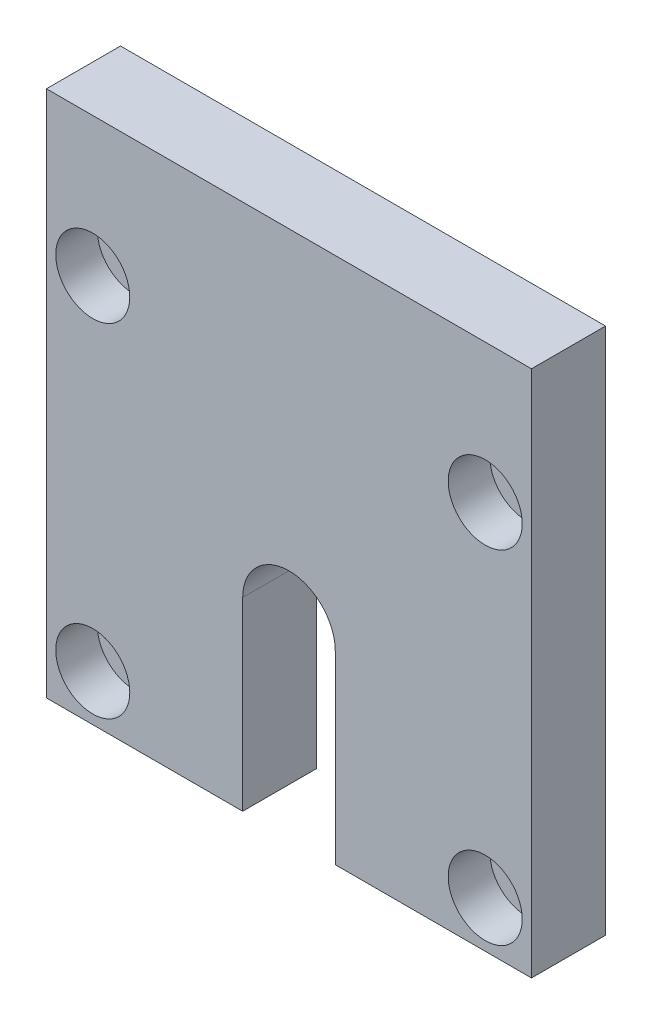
ISO-10303-21;
HEADER;
FILE_DESCRIPTION(('STEP AP214'),'2;1');
FILE_NAME('part.step','',(''),(''),'','','');
FILE_SCHEMA(('AUTOMOTIVE_DESIGN { 1 0 10303 214 1 1 1 1 }'));
ENDSEC;
DATA;
#1=APPLICATION_CONTEXT('core data for automotive mechanical design processes');
#2=APPLICATION_PROTOCOL_DEFINITION('international standard','automotive_design',2000,#1);
#3=PRODUCT_CONTEXT('',#1,'mechanical');
#4=PRODUCT('Part','Part','',(#3));
#5=PRODUCT_RELATED_PRODUCT_CATEGORY('part','',(#4));
#6=PRODUCT_DEFINITION_FORMATION('','',#4);
#7=PRODUCT_DEFINITION_CONTEXT('part definition',#1,'design');
#8=PRODUCT_DEFINITION('design','',#6,#7);
#9=PRODUCT_DEFINITION_SHAPE('','',#8);
#10=(LENGTH_UNIT() NAMED_UNIT(*) SI_UNIT(.MILLI.,.METRE.));
#11=(NAMED_UNIT(*) PLANE_ANGLE_UNIT() SI_UNIT($,.RADIAN.));
#12=(NAMED_UNIT(*) SI_UNIT($,.STERADIAN.) SOLID_ANGLE_UNIT());
#13=UNCERTAINTY_MEASURE_WITH_UNIT(LENGTH_MEASURE(1.E-05),#10,'distance_accuracy_value','');
#14=(GEOMETRIC_REPRESENTATION_CONTEXT(3) GLOBAL_UNCERTAINTY_ASSIGNED_CONTEXT((#13)) GLOBAL_UNIT_ASSIGNED_CONTEXT((#10,
#11,#12)) REPRESENTATION_CONTEXT('',''));
#15=CARTESIAN_POINT('',(0.,0.,0.));
#16=DIRECTION('',(0.,0.,1.));
#17=DIRECTION('',(1.,0.,0.));
#18=AXIS2_PLACEMENT_3D('',#15,#16,#17);
#19=CARTESIAN_POINT('',(5.,5.00000000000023,8.));
#20=DIRECTION('',(0.,0.,-1.));
#21=DIRECTION('',(-1.,0.,0.));
#22=AXIS2_PLACEMENT_3D('',#19,#20,#21);
#23=CYLINDRICAL_SURFACE('',#22,2.25);
#24=CARTESIAN_POINT('',(5.,5.00000000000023,0.));
#25=DIRECTION('',(0.,0.,1.));
#26=DIRECTION('',(1.,0.,0.));
#27=AXIS2_PLACEMENT_3D('',#24,#25,#26);
#28=CIRCLE('',#27,2.25);
#29=CARTESIAN_POINT('',(7.25,5.00000000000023,0.));
#30=VERTEX_POINT('',#29);
#31=EDGE_CURVE('E161',#30,#30,#28,.T.);
#32=ORIENTED_EDGE('',*,*,#31,.F.);
#33=EDGE_LOOP('',(#32));
#34=FACE_BOUND('',#33,.T.);
#35=CARTESIAN_POINT('',(5.,5.00000000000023,3.5));
#36=DIRECTION('',(0.,0.,1.));
#37=DIRECTION('',(1.,0.,0.));
#38=AXIS2_PLACEMENT_3D('',#35,#36,#37);
#39=CIRCLE('',#38,2.25);
#40=CARTESIAN_POINT('',(7.25,5.00000000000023,3.5));
#41=VERTEX_POINT('',#40);
#42=EDGE_CURVE('E36',#41,#41,#39,.T.);
#43=ORIENTED_EDGE('',*,*,#42,.T.);
#44=EDGE_LOOP('',(#43));
#45=FACE_BOUND('',#44,.T.);
#46=ADVANCED_FACE('F32',(#34,#45),#23,.F.);
#47=CARTESIAN_POINT('',(47.4000000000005,5.00000000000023,8.));
#48=DIRECTION('',(0.,0.,-1.));
#49=DIRECTION('',(-1.,0.,0.));
#50=AXIS2_PLACEMENT_3D('',#47,#48,#49);
#51=CYLINDRICAL_SURFACE('',#50,2.25);
#52=CARTESIAN_POINT('',(47.4000000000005,5.00000000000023,0.));
#53=DIRECTION('',(0.,0.,1.));
#54=DIRECTION('',(1.,0.,0.));
#55=AXIS2_PLACEMENT_3D('',#52,#53,#54);
#56=CIRCLE('',#55,2.25);
#57=CARTESIAN_POINT('',(49.6500000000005,5.00000000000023,0.));
#58=VERTEX_POINT('',#57);
#59=EDGE_CURVE('E194',#58,#58,#56,.T.);
#60=ORIENTED_EDGE('',*,*,#59,.F.);
#61=EDGE_LOOP('',(#60));
#62=FACE_BOUND('',#61,.T.);
#63=CARTESIAN_POINT('',(47.4000000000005,5.00000000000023,3.5));
#64=DIRECTION('',(0.,0.,1.));
#65=DIRECTION('',(1.,0.,0.));
#66=AXIS2_PLACEMENT_3D('',#63,#64,#65);
#67=CIRCLE('',#66,2.25);
#68=CARTESIAN_POINT('',(49.6500000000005,5.00000000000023,3.5));
#69=VERTEX_POINT('',#68);
#70=EDGE_CURVE('E167',#69,#69,#67,.T.);
#71=ORIENTED_EDGE('',*,*,#70,.T.);
#72=EDGE_LOOP('',(#71));
#73=FACE_BOUND('',#72,.T.);
#74=ADVANCED_FACE('F239',(#62,#73),#51,.F.);
#75=CARTESIAN_POINT('',(47.4000000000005,42.0000000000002,8.));
#76=DIRECTION('',(0.,0.,-1.));
#77=DIRECTION('',(-1.,0.,0.));
#78=AXIS2_PLACEMENT_3D('',#75,#76,#77);
#79=CYLINDRICAL_SURFACE('',#78,2.25);
#80=CARTESIAN_POINT('',(47.4000000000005,42.0000000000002,0.));
#81=DIRECTION('',(0.,0.,1.));
#82=DIRECTION('',(1.,0.,0.));
#83=AXIS2_PLACEMENT_3D('',#80,#81,#82);
#84=CIRCLE('',#83,2.25);
#85=CARTESIAN_POINT('',(49.6500000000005,42.0000000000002,0.));
#86=VERTEX_POINT('',#85);
#87=EDGE_CURVE('E197',#86,#86,#84,.T.);
#88=ORIENTED_EDGE('',*,*,#87,.F.);
#89=EDGE_LOOP('',(#88));
#90=FACE_BOUND('',#89,.T.);
#91=CARTESIAN_POINT('',(47.4000000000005,42.0000000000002,3.5));
#92=DIRECTION('',(0.,0.,1.));
#93=DIRECTION('',(1.,0.,0.));
#94=AXIS2_PLACEMENT_3D('',#91,#92,#93);
#95=CIRCLE('',#94,2.25);
#96=CARTESIAN_POINT('',(49.6500000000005,42.0000000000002,3.5));
#97=VERTEX_POINT('',#96);
#98=EDGE_CURVE('E163',#97,#97,#95,.T.);
#99=ORIENTED_EDGE('',*,*,#98,.T.);
#100=EDGE_LOOP('',(#99));
#101=FACE_BOUND('',#100,.T.);
#102=ADVANCED_FACE('F245',(#90,#101),#79,.F.);
#103=CARTESIAN_POINT('',(5.,42.0000000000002,8.));
#104=DIRECTION('',(0.,0.,-1.));
#105=DIRECTION('',(-1.,0.,0.));
#106=AXIS2_PLACEMENT_3D('',#103,#104,#105);
#107=CYLINDRICAL_SURFACE('',#106,2.25);
#108=CARTESIAN_POINT('',(5.,42.0000000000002,0.));
#109=DIRECTION('',(0.,0.,1.));
#110=DIRECTION('',(1.,0.,0.));
#111=AXIS2_PLACEMENT_3D('',#108,#109,#110);
#112=CIRCLE('',#111,2.25);
#113=CARTESIAN_POINT('',(7.25,42.0000000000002,0.));
#114=VERTEX_POINT('',#113);
#115=EDGE_CURVE('E135',#114,#114,#112,.T.);
#116=ORIENTED_EDGE('',*,*,#115,.F.);
#117=EDGE_LOOP('',(#116));
#118=FACE_BOUND('',#117,.T.);
#119=CARTESIAN_POINT('',(5.,42.0000000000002,3.5));
#120=DIRECTION('',(0.,0.,1.));
#121=DIRECTION('',(1.,0.,0.));
#122=AXIS2_PLACEMENT_3D('',#119,#120,#121);
#123=CIRCLE('',#122,2.25);
#124=CARTESIAN_POINT('',(7.25,42.0000000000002,3.5));
#125=VERTEX_POINT('',#124);
#126=EDGE_CURVE('E158',#125,#125,#123,.T.);
#127=ORIENTED_EDGE('',*,*,#126,.T.);
#128=EDGE_LOOP('',(#127));
#129=FACE_BOUND('',#128,.T.);
#130=ADVANCED_FACE('F254',(#118,#129),#107,.F.);
#131=CARTESIAN_POINT('',(26.2000000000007,20.0000000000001,8.));
#132=DIRECTION('',(0.,0.,1.));
#133=DIRECTION('',(1.,0.,0.));
#134=AXIS2_PLACEMENT_3D('',#131,#132,#133);
#135=PLANE('',#134);
#136=CARTESIAN_POINT('',(5.,5.00000000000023,8.));
#137=DIRECTION('',(0.,0.,1.));
#138=DIRECTION('',(1.,0.,0.));
#139=AXIS2_PLACEMENT_3D('',#136,#137,#138);
#140=CIRCLE('',#139,4.);
#141=CARTESIAN_POINT('',(9.,5.00000000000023,8.));
#142=VERTEX_POINT('',#141);
#143=EDGE_CURVE('E183',#142,#142,#140,.T.);
#144=ORIENTED_EDGE('',*,*,#143,.F.);
#145=EDGE_LOOP('',(#144));
#146=FACE_BOUND('',#145,.T.);
#147=CARTESIAN_POINT('',(47.4000000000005,5.00000000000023,8.));
#148=DIRECTION('',(0.,0.,1.));
#149=DIRECTION('',(1.,0.,0.));
#150=AXIS2_PLACEMENT_3D('',#147,#148,#149);
#151=CIRCLE('',#150,4.);
#152=CARTESIAN_POINT('',(51.4000000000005,5.00000000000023,8.));
#153=VERTEX_POINT('',#152);
#154=EDGE_CURVE('E176',#153,#153,#151,.T.);
#155=ORIENTED_EDGE('',*,*,#154,.F.);
#156=EDGE_LOOP('',(#155));
#157=FACE_BOUND('',#156,.T.);
#158=CARTESIAN_POINT('',(47.4000000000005,42.0000000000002,8.));
#159=DIRECTION('',(0.,0.,1.));
#160=DIRECTION('',(1.,0.,0.));
#161=AXIS2_PLACEMENT_3D('',#158,#159,#160);
#162=CIRCLE('',#161,4.);
#163=CARTESIAN_POINT('',(51.4000000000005,42.0000000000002,8.));
#164=VERTEX_POINT('',#163);
#165=EDGE_CURVE('E169',#164,#164,#162,.T.);
#166=ORIENTED_EDGE('',*,*,#165,.F.);
#167=EDGE_LOOP('',(#166));
#168=FACE_BOUND('',#167,.T.);
#169=CARTESIAN_POINT('',(5.,42.0000000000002,8.));
#170=DIRECTION('',(0.,0.,1.));
#171=DIRECTION('',(1.,0.,0.));
#172=AXIS2_PLACEMENT_3D('',#169,#170,#171);
#173=CIRCLE('',#172,4.);
#174=CARTESIAN_POINT('',(9.,42.0000000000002,8.));
#175=VERTEX_POINT('',#174);
#176=EDGE_CURVE('E165',#175,#175,#173,.T.);
#177=ORIENTED_EDGE('',*,*,#176,.F.);
#178=EDGE_LOOP('',(#177));
#179=FACE_BOUND('',#178,.T.);
#180=DIRECTION('',(1.,0.,0.));
#181=VECTOR('',#180,1.);
#182=CARTESIAN_POINT('',(0.,1.13686837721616E-13,8.));
#183=LINE('',#182,#181);
#184=CARTESIAN_POINT('',(0.,1.13686837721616E-13,8.));
#185=VERTEX_POINT('',#184);
#186=CARTESIAN_POINT('',(21.2000000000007,1.13686837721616E-13,8.));
#187=VERTEX_POINT('',#186);
#188=EDGE_CURVE('E146',#185,#187,#183,.T.);
#189=ORIENTED_EDGE('',*,*,#188,.T.);
#190=DIRECTION('',(0.,1.,0.));
#191=VECTOR('',#190,1.);
#192=CARTESIAN_POINT('',(21.2000000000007,1.13686837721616E-13,8.));
#193=LINE('',#192,#191);
#194=CARTESIAN_POINT('',(21.2000000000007,20.0000000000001,8.));
#195=VERTEX_POINT('',#194);
#196=EDGE_CURVE('E94',#187,#195,#193,.T.);
#197=ORIENTED_EDGE('',*,*,#196,.T.);
#198=CARTESIAN_POINT('',(26.2000000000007,20.0000000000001,8.));
#199=DIRECTION('',(0.,0.,-1.));
#200=DIRECTION('',(1.,0.,0.));
#201=AXIS2_PLACEMENT_3D('',#198,#199,#200);
#202=CIRCLE('',#201,5.);
#203=CARTESIAN_POINT('',(31.2000000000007,20.0000000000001,8.));
#204=VERTEX_POINT('',#203);
#205=EDGE_CURVE('E204',#195,#204,#202,.T.);
#206=ORIENTED_EDGE('',*,*,#205,.T.);
#207=DIRECTION('',(0.,-1.,0.));
#208=VECTOR('',#207,1.);
#209=CARTESIAN_POINT('',(31.2000000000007,1.13686837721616E-13,8.));
#210=LINE('',#209,#208);
#211=CARTESIAN_POINT('',(31.2000000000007,1.13686837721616E-13,8.));
#212=VERTEX_POINT('',#211);
#213=EDGE_CURVE('E206',#204,#212,#210,.T.);
#214=ORIENTED_EDGE('',*,*,#213,.T.);
#215=DIRECTION('',(1.,0.,0.));
#216=VECTOR('',#215,1.);
#217=CARTESIAN_POINT('',(31.2000000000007,1.13686837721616E-13,8.));
#218=LINE('',#217,#216);
#219=CARTESIAN_POINT('',(52.4000000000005,1.13686837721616E-13,8.));
#220=VERTEX_POINT('',#219);
#221=EDGE_CURVE('E113',#212,#220,#218,.T.);
#222=ORIENTED_EDGE('',*,*,#221,.T.);
#223=DIRECTION('',(0.,1.,0.));
#224=VECTOR('',#223,1.);
#225=CARTESIAN_POINT('',(52.4000000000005,1.13686837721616E-13,8.));
#226=LINE('',#225,#224);
#227=CARTESIAN_POINT('',(52.4000000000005,57.0000000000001,8.));
#228=VERTEX_POINT('',#227);
#229=EDGE_CURVE('E107',#220,#228,#226,.T.);
#230=ORIENTED_EDGE('',*,*,#229,.T.);
#231=DIRECTION('',(-1.,0.,0.));
#232=VECTOR('',#231,1.);
#233=CARTESIAN_POINT('',(0.,57.0000000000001,8.));
#234=LINE('',#233,#232);
#235=CARTESIAN_POINT('',(0.,57.0000000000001,8.));
#236=VERTEX_POINT('',#235);
#237=EDGE_CURVE('E111',#228,#236,#234,.T.);
#238=ORIENTED_EDGE('',*,*,#237,.T.);
#239=DIRECTION('',(0.,-1.,0.));
#240=VECTOR('',#239,1.);
#241=CARTESIAN_POINT('',(0.,1.13686837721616E-13,8.));
#242=LINE('',#241,#240);
#243=EDGE_CURVE('E51',#236,#185,#242,.T.);
#244=ORIENTED_EDGE('',*,*,#243,.T.);
#245=EDGE_LOOP('',(#189,#197,#206,#214,#222,#230,#238,#244));
#246=FACE_BOUND('',#245,.T.);
#247=ADVANCED_FACE('F109',(#146,#157,#168,#179,#246),#135,.T.);
#248=CARTESIAN_POINT('',(26.2000000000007,20.0000000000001,0.));
#249=DIRECTION('',(0.,0.,1.));
#250=DIRECTION('',(1.,0.,0.));
#251=AXIS2_PLACEMENT_3D('',#248,#249,#250);
#252=PLANE('',#251);
#253=ORIENTED_EDGE('',*,*,#59,.T.);
#254=EDGE_LOOP('',(#253));
#255=FACE_BOUND('',#254,.T.);
#256=ORIENTED_EDGE('',*,*,#115,.T.);
#257=EDGE_LOOP('',(#256));
#258=FACE_BOUND('',#257,.T.);
#259=DIRECTION('',(1.,0.,0.));
#260=VECTOR('',#259,1.);
#261=CARTESIAN_POINT('',(0.,1.13686837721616E-13,0.));
#262=LINE('',#261,#260);
#263=CARTESIAN_POINT('',(0.,1.13686837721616E-13,0.));
#264=VERTEX_POINT('',#263);
#265=CARTESIAN_POINT('',(21.2000000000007,1.13686837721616E-13,0.));
#266=VERTEX_POINT('',#265);
#267=EDGE_CURVE('E131',#264,#266,#262,.T.);
#268=ORIENTED_EDGE('',*,*,#267,.F.);
#269=DIRECTION('',(0.,-1.,0.));
#270=VECTOR('',#269,1.);
#271=CARTESIAN_POINT('',(0.,1.13686837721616E-13,0.));
#272=LINE('',#271,#270);
#273=CARTESIAN_POINT('',(0.,57.0000000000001,0.));
#274=VERTEX_POINT('',#273);
#275=EDGE_CURVE('E86',#274,#264,#272,.T.);
#276=ORIENTED_EDGE('',*,*,#275,.F.);
#277=DIRECTION('',(-1.,0.,0.));
#278=VECTOR('',#277,1.);
#279=CARTESIAN_POINT('',(0.,57.0000000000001,0.));
#280=LINE('',#279,#278);
#281=CARTESIAN_POINT('',(52.4000000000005,57.0000000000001,0.));
#282=VERTEX_POINT('',#281);
#283=EDGE_CURVE('E80',#282,#274,#280,.T.);
#284=ORIENTED_EDGE('',*,*,#283,.F.);
#285=DIRECTION('',(0.,1.,0.));
#286=VECTOR('',#285,1.);
#287=CARTESIAN_POINT('',(52.4000000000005,1.13686837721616E-13,0.));
#288=LINE('',#287,#286);
#289=CARTESIAN_POINT('',(52.4000000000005,1.13686837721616E-13,0.));
#290=VERTEX_POINT('',#289);
#291=EDGE_CURVE('E121',#290,#282,#288,.T.);
#292=ORIENTED_EDGE('',*,*,#291,.F.);
#293=DIRECTION('',(1.,0.,0.));
#294=VECTOR('',#293,1.);
#295=CARTESIAN_POINT('',(31.2000000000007,1.13686837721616E-13,0.));
#296=LINE('',#295,#294);
#297=CARTESIAN_POINT('',(31.2000000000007,1.13686837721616E-13,0.));
#298=VERTEX_POINT('',#297);
#299=EDGE_CURVE('E141',#298,#290,#296,.T.);
#300=ORIENTED_EDGE('',*,*,#299,.F.);
#301=DIRECTION('',(0.,-1.,0.));
#302=VECTOR('',#301,1.);
#303=CARTESIAN_POINT('',(31.2000000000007,1.13686837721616E-13,0.));
#304=LINE('',#303,#302);
#305=CARTESIAN_POINT('',(31.2000000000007,20.0000000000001,0.));
#306=VERTEX_POINT('',#305);
#307=EDGE_CURVE('E139',#306,#298,#304,.T.);
#308=ORIENTED_EDGE('',*,*,#307,.F.);
#309=CARTESIAN_POINT('',(26.2000000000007,20.0000000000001,0.));
#310=DIRECTION('',(0.,0.,-1.));
#311=DIRECTION('',(1.,0.,0.));
#312=AXIS2_PLACEMENT_3D('',#309,#310,#311);
#313=CIRCLE('',#312,5.);
#314=CARTESIAN_POINT('',(21.2000000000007,20.0000000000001,0.));
#315=VERTEX_POINT('',#314);
#316=EDGE_CURVE('E137',#315,#306,#313,.T.);
#317=ORIENTED_EDGE('',*,*,#316,.F.);
#318=DIRECTION('',(0.,1.,0.));
#319=VECTOR('',#318,1.);
#320=CARTESIAN_POINT('',(21.2000000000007,1.13686837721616E-13,0.));
#321=LINE('',#320,#319);
#322=EDGE_CURVE('E134',#266,#315,#321,.T.);
#323=ORIENTED_EDGE('',*,*,#322,.F.);
#324=EDGE_LOOP('',(#268,#276,#284,#292,#300,#308,#317,#323));
#325=FACE_BOUND('',#324,.T.);
#326=ORIENTED_EDGE('',*,*,#87,.T.);
#327=EDGE_LOOP('',(#326));
#328=FACE_BOUND('',#327,.T.);
#329=ORIENTED_EDGE('',*,*,#31,.T.);
#330=EDGE_LOOP('',(#329));
#331=FACE_BOUND('',#330,.T.);
#332=ADVANCED_FACE('F219',(#255,#258,#325,#328,#331),#252,.F.);
#333=CARTESIAN_POINT('',(0.,1.13686837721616E-13,8.));
#334=DIRECTION('',(0.,1.,0.));
#335=DIRECTION('',(0.,0.,1.));
#336=AXIS2_PLACEMENT_3D('',#333,#334,#335);
#337=PLANE('',#336);
#338=ORIENTED_EDGE('',*,*,#267,.T.);
#339=DIRECTION('',(0.,0.,-1.));
#340=VECTOR('',#339,1.);
#341=CARTESIAN_POINT('',(21.2000000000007,1.13686837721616E-13,8.));
#342=LINE('',#341,#340);
#343=EDGE_CURVE('E11',#187,#266,#342,.T.);
#344=ORIENTED_EDGE('',*,*,#343,.F.);
#345=ORIENTED_EDGE('',*,*,#188,.F.);
#346=DIRECTION('',(0.,0.,-1.));
#347=VECTOR('',#346,1.);
#348=CARTESIAN_POINT('',(0.,1.13686837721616E-13,8.));
#349=LINE('',#348,#347);
#350=EDGE_CURVE('E127',#185,#264,#349,.T.);
#351=ORIENTED_EDGE('',*,*,#350,.T.);
#352=EDGE_LOOP('',(#338,#344,#345,#351));
#353=FACE_BOUND('',#352,.T.);
#354=ADVANCED_FACE('F34',(#353),#337,.F.);
#355=CARTESIAN_POINT('',(21.2000000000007,1.13686837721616E-13,8.));
#356=DIRECTION('',(-1.,0.,0.));
#357=DIRECTION('',(0.,0.,1.));
#358=AXIS2_PLACEMENT_3D('',#355,#356,#357);
#359=PLANE('',#358);
#360=ORIENTED_EDGE('',*,*,#322,.T.);
#361=DIRECTION('',(0.,0.,-1.));
#362=VECTOR('',#361,1.);
#363=CARTESIAN_POINT('',(21.2000000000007,20.0000000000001,8.));
#364=LINE('',#363,#362);
#365=EDGE_CURVE('E42',#195,#315,#364,.T.);
#366=ORIENTED_EDGE('',*,*,#365,.F.);
#367=ORIENTED_EDGE('',*,*,#196,.F.);
#368=ORIENTED_EDGE('',*,*,#343,.T.);
#369=EDGE_LOOP('',(#360,#366,#367,#368));
#370=FACE_BOUND('',#369,.T.);
#371=ADVANCED_FACE('F266',(#370),#359,.F.);
#372=CARTESIAN_POINT('',(26.2000000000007,20.0000000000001,8.));
#373=DIRECTION('',(0.,0.,-1.));
#374=DIRECTION('',(-1.,0.,0.));
#375=AXIS2_PLACEMENT_3D('',#372,#373,#374);
#376=CYLINDRICAL_SURFACE('',#375,5.);
#377=ORIENTED_EDGE('',*,*,#316,.T.);
#378=DIRECTION('',(0.,0.,-1.));
#379=VECTOR('',#378,1.);
#380=CARTESIAN_POINT('',(31.2000000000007,20.0000000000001,8.));
#381=LINE('',#380,#379);
#382=EDGE_CURVE('E153',#204,#306,#381,.T.);
#383=ORIENTED_EDGE('',*,*,#382,.F.);
#384=ORIENTED_EDGE('',*,*,#205,.F.);
#385=ORIENTED_EDGE('',*,*,#365,.T.);
#386=EDGE_LOOP('',(#377,#383,#384,#385));
#387=FACE_BOUND('',#386,.T.);
#388=ADVANCED_FACE('F416',(#387),#376,.F.);
#389=CARTESIAN_POINT('',(31.2000000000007,1.13686837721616E-13,8.));
#390=DIRECTION('',(1.,0.,0.));
#391=DIRECTION('',(0.,0.,-1.));
#392=AXIS2_PLACEMENT_3D('',#389,#390,#391);
#393=PLANE('',#392);
#394=ORIENTED_EDGE('',*,*,#307,.T.);
#395=DIRECTION('',(0.,0.,-1.));
#396=VECTOR('',#395,1.);
#397=CARTESIAN_POINT('',(31.2000000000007,1.13686837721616E-13,8.));
#398=LINE('',#397,#396);
#399=EDGE_CURVE('E150',#212,#298,#398,.T.);
#400=ORIENTED_EDGE('',*,*,#399,.F.);
#401=ORIENTED_EDGE('',*,*,#213,.F.);
#402=ORIENTED_EDGE('',*,*,#382,.T.);
#403=EDGE_LOOP('',(#394,#400,#401,#402));
#404=FACE_BOUND('',#403,.T.);
#405=ADVANCED_FACE('F212',(#404),#393,.F.);
#406=CARTESIAN_POINT('',(31.2000000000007,1.13686837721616E-13,8.));
#407=DIRECTION('',(0.,1.,0.));
#408=DIRECTION('',(0.,0.,1.));
#409=AXIS2_PLACEMENT_3D('',#406,#407,#408);
#410=PLANE('',#409);
#411=ORIENTED_EDGE('',*,*,#299,.T.);
#412=DIRECTION('',(0.,0.,-1.));
#413=VECTOR('',#412,1.);
#414=CARTESIAN_POINT('',(52.4000000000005,1.13686837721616E-13,8.));
#415=LINE('',#414,#413);
#416=EDGE_CURVE('E122',#220,#290,#415,.T.);
#417=ORIENTED_EDGE('',*,*,#416,.F.);
#418=ORIENTED_EDGE('',*,*,#221,.F.);
#419=ORIENTED_EDGE('',*,*,#399,.T.);
#420=EDGE_LOOP('',(#411,#417,#418,#419));
#421=FACE_BOUND('',#420,.T.);
#422=ADVANCED_FACE('F216',(#421),#410,.F.);
#423=CARTESIAN_POINT('',(52.4000000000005,1.13686837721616E-13,8.));
#424=DIRECTION('',(-1.,0.,0.));
#425=DIRECTION('',(0.,0.,1.));
#426=AXIS2_PLACEMENT_3D('',#423,#424,#425);
#427=PLANE('',#426);
#428=ORIENTED_EDGE('',*,*,#291,.T.);
#429=DIRECTION('',(0.,0.,-1.));
#430=VECTOR('',#429,1.);
#431=CARTESIAN_POINT('',(52.4000000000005,57.0000000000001,8.));
#432=LINE('',#431,#430);
#433=EDGE_CURVE('E118',#228,#282,#432,.T.);
#434=ORIENTED_EDGE('',*,*,#433,.F.);
#435=ORIENTED_EDGE('',*,*,#229,.F.);
#436=ORIENTED_EDGE('',*,*,#416,.T.);
#437=EDGE_LOOP('',(#428,#434,#435,#436));
#438=FACE_BOUND('',#437,.T.);
#439=ADVANCED_FACE('F119',(#438),#427,.F.);
#440=CARTESIAN_POINT('',(0.,57.0000000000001,8.));
#441=DIRECTION('',(0.,-1.,0.));
#442=DIRECTION('',(0.,0.,-1.));
#443=AXIS2_PLACEMENT_3D('',#440,#441,#442);
#444=PLANE('',#443);
#445=ORIENTED_EDGE('',*,*,#283,.T.);
#446=DIRECTION('',(0.,0.,-1.));
#447=VECTOR('',#446,1.);
#448=CARTESIAN_POINT('',(0.,57.0000000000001,8.));
#449=LINE('',#448,#447);
#450=EDGE_CURVE('E123',#236,#274,#449,.T.);
#451=ORIENTED_EDGE('',*,*,#450,.F.);
#452=ORIENTED_EDGE('',*,*,#237,.F.);
#453=ORIENTED_EDGE('',*,*,#433,.T.);
#454=EDGE_LOOP('',(#445,#451,#452,#453));
#455=FACE_BOUND('',#454,.T.);
#456=ADVANCED_FACE('F125',(#455),#444,.F.);
#457=CARTESIAN_POINT('',(0.,1.13686837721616E-13,8.));
#458=DIRECTION('',(1.,0.,0.));
#459=DIRECTION('',(0.,0.,-1.));
#460=AXIS2_PLACEMENT_3D('',#457,#458,#459);
#461=PLANE('',#460);
#462=ORIENTED_EDGE('',*,*,#275,.T.);
#463=ORIENTED_EDGE('',*,*,#350,.F.);
#464=ORIENTED_EDGE('',*,*,#243,.F.);
#465=ORIENTED_EDGE('',*,*,#450,.T.);
#466=EDGE_LOOP('',(#462,#463,#464,#465));
#467=FACE_BOUND('',#466,.T.);
#468=ADVANCED_FACE('F225',(#467),#461,.F.);
#469=CARTESIAN_POINT('',(5.,42.0000000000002,3.5));
#470=DIRECTION('',(0.,0.,1.));
#471=DIRECTION('',(1.,0.,0.));
#472=AXIS2_PLACEMENT_3D('',#469,#470,#471);
#473=CYLINDRICAL_SURFACE('',#472,4.);
#474=CARTESIAN_POINT('',(5.,42.0000000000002,3.5));
#475=DIRECTION('',(0.,0.,1.));
#476=DIRECTION('',(1.,0.,0.));
#477=AXIS2_PLACEMENT_3D('',#474,#475,#476);
#478=CIRCLE('',#477,4.);
#479=CARTESIAN_POINT('',(9.,42.0000000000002,3.5));
#480=VERTEX_POINT('',#479);
#481=EDGE_CURVE('E162',#480,#480,#478,.T.);
#482=ORIENTED_EDGE('',*,*,#481,.F.);
#483=EDGE_LOOP('',(#482));
#484=FACE_BOUND('',#483,.T.);
#485=ORIENTED_EDGE('',*,*,#176,.T.);
#486=EDGE_LOOP('',(#485));
#487=FACE_BOUND('',#486,.T.);
#488=ADVANCED_FACE('F227',(#484,#487),#473,.F.);
#489=CARTESIAN_POINT('',(5.,42.0000000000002,3.5));
#490=DIRECTION('',(0.,0.,1.));
#491=DIRECTION('',(1.,0.,0.));
#492=AXIS2_PLACEMENT_3D('',#489,#490,#491);
#493=PLANE('',#492);
#494=ORIENTED_EDGE('',*,*,#126,.F.);
#495=EDGE_LOOP('',(#494));
#496=FACE_BOUND('',#495,.T.);
#497=ORIENTED_EDGE('',*,*,#481,.T.);
#498=EDGE_LOOP('',(#497));
#499=FACE_BOUND('',#498,.T.);
#500=ADVANCED_FACE('F233',(#496,#499),#493,.T.);
#501=CARTESIAN_POINT('',(47.4000000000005,42.0000000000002,3.5));
#502=DIRECTION('',(0.,0.,1.));
#503=DIRECTION('',(1.,0.,0.));
#504=AXIS2_PLACEMENT_3D('',#501,#502,#503);
#505=CYLINDRICAL_SURFACE('',#504,4.);
#506=CARTESIAN_POINT('',(47.4000000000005,42.0000000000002,3.5));
#507=DIRECTION('',(0.,0.,1.));
#508=DIRECTION('',(1.,0.,0.));
#509=AXIS2_PLACEMENT_3D('',#506,#507,#508);
#510=CIRCLE('',#509,4.);
#511=CARTESIAN_POINT('',(51.4000000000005,42.0000000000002,3.5));
#512=VERTEX_POINT('',#511);
#513=EDGE_CURVE('E166',#512,#512,#510,.T.);
#514=ORIENTED_EDGE('',*,*,#513,.F.);
#515=EDGE_LOOP('',(#514));
#516=FACE_BOUND('',#515,.T.);
#517=ORIENTED_EDGE('',*,*,#165,.T.);
#518=EDGE_LOOP('',(#517));
#519=FACE_BOUND('',#518,.T.);
#520=ADVANCED_FACE('F275',(#516,#519),#505,.F.);
#521=CARTESIAN_POINT('',(47.4000000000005,42.0000000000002,3.5));
#522=DIRECTION('',(0.,0.,1.));
#523=DIRECTION('',(1.,0.,0.));
#524=AXIS2_PLACEMENT_3D('',#521,#522,#523);
#525=PLANE('',#524);
#526=ORIENTED_EDGE('',*,*,#98,.F.);
#527=EDGE_LOOP('',(#526));
#528=FACE_BOUND('',#527,.T.);
#529=ORIENTED_EDGE('',*,*,#513,.T.);
#530=EDGE_LOOP('',(#529));
#531=FACE_BOUND('',#530,.T.);
#532=ADVANCED_FACE('F283',(#528,#531),#525,.T.);
#533=CARTESIAN_POINT('',(47.4000000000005,5.00000000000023,3.5));
#534=DIRECTION('',(0.,0.,1.));
#535=DIRECTION('',(1.,0.,0.));
#536=AXIS2_PLACEMENT_3D('',#533,#534,#535);
#537=CYLINDRICAL_SURFACE('',#536,4.);
#538=CARTESIAN_POINT('',(47.4000000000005,5.00000000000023,3.5));
#539=DIRECTION('',(0.,0.,1.));
#540=DIRECTION('',(1.,0.,0.));
#541=AXIS2_PLACEMENT_3D('',#538,#539,#540);
#542=CIRCLE('',#541,4.);
#543=CARTESIAN_POINT('',(51.4000000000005,5.00000000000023,3.5));
#544=VERTEX_POINT('',#543);
#545=EDGE_CURVE('E170',#544,#544,#542,.T.);
#546=ORIENTED_EDGE('',*,*,#545,.F.);
#547=EDGE_LOOP('',(#546));
#548=FACE_BOUND('',#547,.T.);
#549=ORIENTED_EDGE('',*,*,#154,.T.);
#550=EDGE_LOOP('',(#549));
#551=FACE_BOUND('',#550,.T.);
#552=ADVANCED_FACE('F289',(#548,#551),#537,.F.);
#553=CARTESIAN_POINT('',(47.4000000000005,5.00000000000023,3.5));
#554=DIRECTION('',(0.,0.,1.));
#555=DIRECTION('',(1.,0.,0.));
#556=AXIS2_PLACEMENT_3D('',#553,#554,#555);
#557=PLANE('',#556);
#558=ORIENTED_EDGE('',*,*,#70,.F.);
#559=EDGE_LOOP('',(#558));
#560=FACE_BOUND('',#559,.T.);
#561=ORIENTED_EDGE('',*,*,#545,.T.);
#562=EDGE_LOOP('',(#561));
#563=FACE_BOUND('',#562,.T.);
#564=ADVANCED_FACE('F293',(#560,#563),#557,.T.);
#565=CARTESIAN_POINT('',(5.,5.00000000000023,3.5));
#566=DIRECTION('',(0.,0.,1.));
#567=DIRECTION('',(1.,0.,0.));
#568=AXIS2_PLACEMENT_3D('',#565,#566,#567);
#569=CYLINDRICAL_SURFACE('',#568,4.);
#570=CARTESIAN_POINT('',(5.,5.00000000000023,3.5));
#571=DIRECTION('',(0.,0.,1.));
#572=DIRECTION('',(1.,0.,0.));
#573=AXIS2_PLACEMENT_3D('',#570,#571,#572);
#574=CIRCLE('',#573,4.);
#575=CARTESIAN_POINT('',(9.,5.00000000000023,3.5));
#576=VERTEX_POINT('',#575);
#577=EDGE_CURVE('E312',#576,#576,#574,.T.);
#578=ORIENTED_EDGE('',*,*,#577,.F.);
#579=EDGE_LOOP('',(#578));
#580=FACE_BOUND('',#579,.T.);
#581=ORIENTED_EDGE('',*,*,#143,.T.);
#582=EDGE_LOOP('',(#581));
#583=FACE_BOUND('',#582,.T.);
#584=ADVANCED_FACE('F297',(#580,#583),#569,.F.);
#585=CARTESIAN_POINT('',(5.,5.00000000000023,3.5));
#586=DIRECTION('',(0.,0.,1.));
#587=DIRECTION('',(1.,0.,0.));
#588=AXIS2_PLACEMENT_3D('',#585,#586,#587);
#589=PLANE('',#588);
#590=ORIENTED_EDGE('',*,*,#42,.F.);
#591=EDGE_LOOP('',(#590));
#592=FACE_BOUND('',#591,.T.);
#593=ORIENTED_EDGE('',*,*,#577,.T.);
#594=EDGE_LOOP('',(#593));
#595=FACE_BOUND('',#594,.T.);
#596=ADVANCED_FACE('F301',(#592,#595),#589,.T.);
#597=CLOSED_SHELL('',(#46,#74,#102,#130,#247,#332,#354,#371,#388,#405,#422,#439,#456,#468,#488,
#500,#520,#532,#552,#564,#584,#596));
#598=MANIFOLD_SOLID_BREP('B2',#597);
#599=ADVANCED_BREP_SHAPE_REPRESENTATION('',(#18,#598),#14);
#600=SHAPE_DEFINITION_REPRESENTATION(#9,#599);
ENDSEC;
END-ISO-10303-21;
